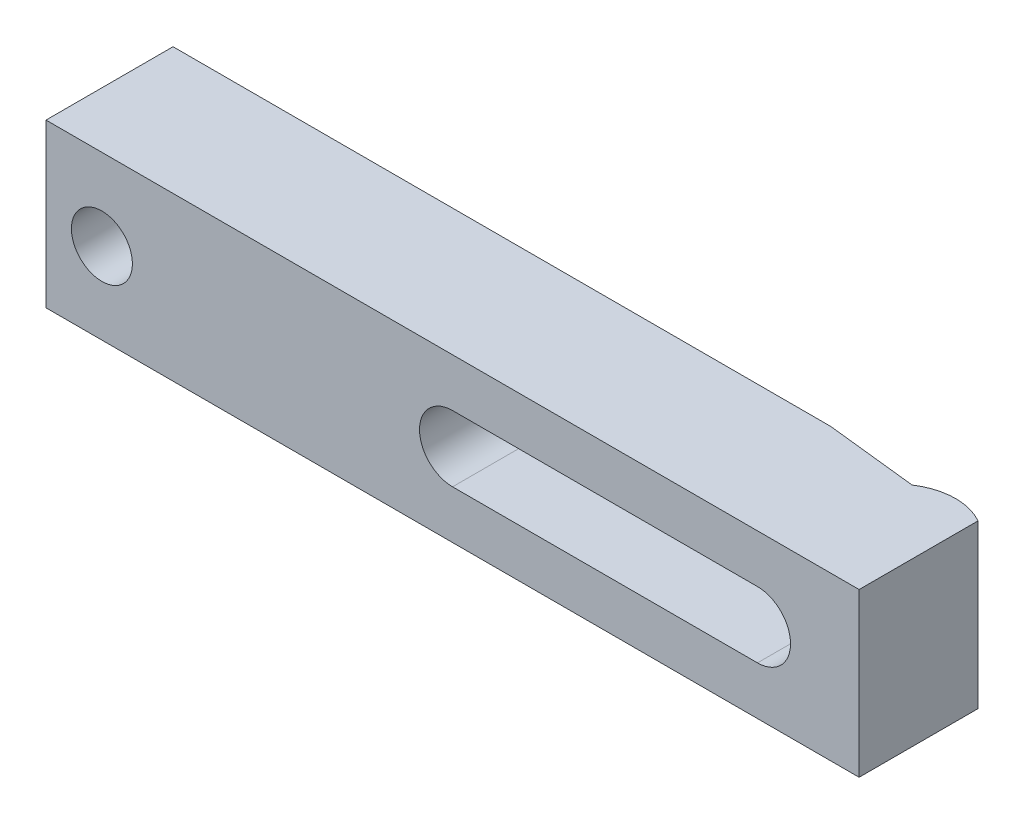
ISO-10303-21;
HEADER;
FILE_DESCRIPTION(('STEP AP214'),'2;1');
FILE_NAME('part.step','',(''),(''),'','','');
FILE_SCHEMA(('AUTOMOTIVE_DESIGN { 1 0 10303 214 1 1 1 1 }'));
ENDSEC;
DATA;
#1=APPLICATION_CONTEXT('core data for automotive mechanical design processes');
#2=APPLICATION_PROTOCOL_DEFINITION('international standard','automotive_design',2000,#1);
#3=PRODUCT_CONTEXT('',#1,'mechanical');
#4=PRODUCT('Part','Part','',(#3));
#5=PRODUCT_RELATED_PRODUCT_CATEGORY('part','',(#4));
#6=PRODUCT_DEFINITION_FORMATION('','',#4);
#7=PRODUCT_DEFINITION_CONTEXT('part definition',#1,'design');
#8=PRODUCT_DEFINITION('design','',#6,#7);
#9=PRODUCT_DEFINITION_SHAPE('','',#8);
#10=(LENGTH_UNIT() NAMED_UNIT(*) SI_UNIT(.MILLI.,.METRE.));
#11=(NAMED_UNIT(*) PLANE_ANGLE_UNIT() SI_UNIT($,.RADIAN.));
#12=(NAMED_UNIT(*) SI_UNIT($,.STERADIAN.) SOLID_ANGLE_UNIT());
#13=UNCERTAINTY_MEASURE_WITH_UNIT(LENGTH_MEASURE(1.E-05),#10,'distance_accuracy_value','');
#14=(GEOMETRIC_REPRESENTATION_CONTEXT(3) GLOBAL_UNCERTAINTY_ASSIGNED_CONTEXT((#13)) GLOBAL_UNIT_ASSIGNED_CONTEXT((#10,
#11,#12)) REPRESENTATION_CONTEXT('',''));
#15=CARTESIAN_POINT('',(0.,0.,0.));
#16=DIRECTION('',(0.,0.,1.));
#17=DIRECTION('',(1.,0.,0.));
#18=AXIS2_PLACEMENT_3D('',#15,#16,#17);
#19=CARTESIAN_POINT('',(-140.,16.,0.));
#20=DIRECTION('',(0.,0.,-1.));
#21=DIRECTION('',(-1.,0.,0.));
#22=AXIS2_PLACEMENT_3D('',#19,#20,#21);
#23=PLANE('',#22);
#24=DIRECTION('',(1.,0.,0.));
#25=VECTOR('',#24,1.);
#26=CARTESIAN_POINT('',(-60.,6.5,0.));
#27=LINE('',#26,#25);
#28=CARTESIAN_POINT('',(-140.,6.5,0.));
#29=VERTEX_POINT('',#28);
#30=CARTESIAN_POINT('',(-10.6,6.5,0.));
#31=VERTEX_POINT('',#30);
#32=EDGE_CURVE('E122',#29,#31,#27,.T.);
#33=ORIENTED_EDGE('',*,*,#32,.F.);
#34=DIRECTION('',(0.,-1.,0.));
#35=VECTOR('',#34,1.);
#36=CARTESIAN_POINT('',(-140.,16.,0.));
#37=LINE('',#36,#35);
#38=CARTESIAN_POINT('',(-140.,16.,0.));
#39=VERTEX_POINT('',#38);
#40=EDGE_CURVE('E139',#39,#29,#37,.T.);
#41=ORIENTED_EDGE('',*,*,#40,.F.);
#42=DIRECTION('',(1.,0.,0.));
#43=VECTOR('',#42,1.);
#44=CARTESIAN_POINT('',(-140.,16.,0.));
#45=LINE('',#44,#43);
#46=CARTESIAN_POINT('',(-10.6,16.,0.));
#47=VERTEX_POINT('',#46);
#48=EDGE_CURVE('E196',#39,#47,#45,.T.);
#49=ORIENTED_EDGE('',*,*,#48,.T.);
#50=DIRECTION('',(0.,-1.,0.));
#51=VECTOR('',#50,1.);
#52=CARTESIAN_POINT('',(-10.6,16.,0.));
#53=LINE('',#52,#51);
#54=EDGE_CURVE('E147',#47,#31,#53,.T.);
#55=ORIENTED_EDGE('',*,*,#54,.T.);
#56=EDGE_LOOP('',(#33,#41,#49,#55));
#57=FACE_BOUND('',#56,.T.);
#58=ADVANCED_FACE('F14',(#57),#23,.T.);
#59=CARTESIAN_POINT('',(-140.,16.,25.));
#60=DIRECTION('',(-1.,0.,0.));
#61=DIRECTION('',(0.,0.,1.));
#62=AXIS2_PLACEMENT_3D('',#59,#60,#61);
#63=PLANE('',#62);
#64=ORIENTED_EDGE('',*,*,#40,.T.);
#65=DIRECTION('',(0.,0.,1.));
#66=VECTOR('',#65,1.);
#67=CARTESIAN_POINT('',(-140.,6.5,25.));
#68=LINE('',#67,#66);
#69=CARTESIAN_POINT('',(-140.,6.5,5.));
#70=VERTEX_POINT('',#69);
#71=EDGE_CURVE('E133',#29,#70,#68,.T.);
#72=ORIENTED_EDGE('',*,*,#71,.T.);
#73=DIRECTION('',(0.,-1.,0.));
#74=VECTOR('',#73,1.);
#75=CARTESIAN_POINT('',(-140.,16.,5.));
#76=LINE('',#75,#74);
#77=CARTESIAN_POINT('',(-140.,-6.5,5.));
#78=VERTEX_POINT('',#77);
#79=EDGE_CURVE('E132',#70,#78,#76,.T.);
#80=ORIENTED_EDGE('',*,*,#79,.T.);
#81=DIRECTION('',(0.,0.,1.));
#82=VECTOR('',#81,1.);
#83=CARTESIAN_POINT('',(-140.,-6.5,25.));
#84=LINE('',#83,#82);
#85=CARTESIAN_POINT('',(-140.,-6.5,0.));
#86=VERTEX_POINT('',#85);
#87=EDGE_CURVE('E115',#86,#78,#84,.T.);
#88=ORIENTED_EDGE('',*,*,#87,.F.);
#89=CARTESIAN_POINT('',(-140.,-16.,0.));
#90=VERTEX_POINT('',#89);
#91=EDGE_CURVE('E129',#86,#90,#37,.T.);
#92=ORIENTED_EDGE('',*,*,#91,.T.);
#93=DIRECTION('',(0.,0.,-1.));
#94=VECTOR('',#93,1.);
#95=CARTESIAN_POINT('',(-140.,-16.,25.));
#96=LINE('',#95,#94);
#97=CARTESIAN_POINT('',(-140.,-16.,25.));
#98=VERTEX_POINT('',#97);
#99=EDGE_CURVE('E169',#98,#90,#96,.T.);
#100=ORIENTED_EDGE('',*,*,#99,.F.);
#101=DIRECTION('',(0.,-1.,0.));
#102=VECTOR('',#101,1.);
#103=CARTESIAN_POINT('',(-140.,16.,25.));
#104=LINE('',#103,#102);
#105=CARTESIAN_POINT('',(-140.,16.,25.));
#106=VERTEX_POINT('',#105);
#107=EDGE_CURVE('E140',#106,#98,#104,.T.);
#108=ORIENTED_EDGE('',*,*,#107,.F.);
#109=DIRECTION('',(0.,0.,-1.));
#110=VECTOR('',#109,1.);
#111=CARTESIAN_POINT('',(-140.,16.,25.));
#112=LINE('',#111,#110);
#113=EDGE_CURVE('E179',#106,#39,#112,.T.);
#114=ORIENTED_EDGE('',*,*,#113,.T.);
#115=EDGE_LOOP('',(#64,#72,#80,#88,#92,#100,#108,#114));
#116=FACE_BOUND('',#115,.T.);
#117=ADVANCED_FACE('F127',(#116),#63,.T.);
#118=CARTESIAN_POINT('',(-60.,0.,25.));
#119=DIRECTION('',(0.,0.,-1.));
#120=DIRECTION('',(-1.,0.,0.));
#121=AXIS2_PLACEMENT_3D('',#118,#119,#120);
#122=CYLINDRICAL_SURFACE('',#121,6.5);
#123=DIRECTION('',(0.,0.,-1.));
#124=VECTOR('',#123,1.);
#125=CARTESIAN_POINT('',(-60.,-6.5,25.));
#126=LINE('',#125,#124);
#127=CARTESIAN_POINT('',(-60.,-6.5,25.));
#128=VERTEX_POINT('',#127);
#129=CARTESIAN_POINT('',(-60.,-6.5,5.));
#130=VERTEX_POINT('',#129);
#131=EDGE_CURVE('E229',#128,#130,#126,.T.);
#132=ORIENTED_EDGE('',*,*,#131,.T.);
#133=CARTESIAN_POINT('',(-60.,0.,5.));
#134=DIRECTION('',(0.,0.,-1.));
#135=DIRECTION('',(-1.,0.,0.));
#136=AXIS2_PLACEMENT_3D('',#133,#134,#135);
#137=CIRCLE('',#136,6.5);
#138=CARTESIAN_POINT('',(-60.,6.5,5.));
#139=VERTEX_POINT('',#138);
#140=EDGE_CURVE('E245',#130,#139,#137,.T.);
#141=ORIENTED_EDGE('',*,*,#140,.T.);
#142=DIRECTION('',(0.,0.,-1.));
#143=VECTOR('',#142,1.);
#144=CARTESIAN_POINT('',(-60.,6.5,25.));
#145=LINE('',#144,#143);
#146=CARTESIAN_POINT('',(-60.,6.5,25.));
#147=VERTEX_POINT('',#146);
#148=EDGE_CURVE('E231',#147,#139,#145,.T.);
#149=ORIENTED_EDGE('',*,*,#148,.F.);
#150=CARTESIAN_POINT('',(-60.,0.,25.));
#151=DIRECTION('',(0.,0.,1.));
#152=DIRECTION('',(1.,0.,0.));
#153=AXIS2_PLACEMENT_3D('',#150,#151,#152);
#154=CIRCLE('',#153,6.5);
#155=EDGE_CURVE('E38',#147,#128,#154,.T.);
#156=ORIENTED_EDGE('',*,*,#155,.T.);
#157=EDGE_LOOP('',(#132,#141,#149,#156));
#158=FACE_BOUND('',#157,.T.);
#159=ADVANCED_FACE('F244',(#158),#122,.F.);
#160=CARTESIAN_POINT('',(-129.,0.,25.));
#161=DIRECTION('',(0.,0.,-1.));
#162=DIRECTION('',(-1.,0.,0.));
#163=AXIS2_PLACEMENT_3D('',#160,#161,#162);
#164=CYLINDRICAL_SURFACE('',#163,6.);
#165=CARTESIAN_POINT('',(-129.,0.,25.));
#166=DIRECTION('',(0.,0.,1.));
#167=DIRECTION('',(1.,0.,0.));
#168=AXIS2_PLACEMENT_3D('',#165,#166,#167);
#169=CIRCLE('',#168,6.);
#170=CARTESIAN_POINT('',(-123.,0.,25.));
#171=VERTEX_POINT('',#170);
#172=EDGE_CURVE('E209',#171,#171,#169,.T.);
#173=ORIENTED_EDGE('',*,*,#172,.T.);
#174=EDGE_LOOP('',(#173));
#175=FACE_BOUND('',#174,.T.);
#176=CARTESIAN_POINT('',(-129.,0.,5.));
#177=DIRECTION('',(0.,0.,-1.));
#178=DIRECTION('',(-1.,0.,0.));
#179=AXIS2_PLACEMENT_3D('',#176,#177,#178);
#180=CIRCLE('',#179,6.);
#181=CARTESIAN_POINT('',(-135.,0.,5.));
#182=VERTEX_POINT('',#181);
#183=EDGE_CURVE('E18',#182,#182,#180,.T.);
#184=ORIENTED_EDGE('',*,*,#183,.T.);
#185=EDGE_LOOP('',(#184));
#186=FACE_BOUND('',#185,.T.);
#187=ADVANCED_FACE('F278',(#175,#186),#164,.F.);
#188=CARTESIAN_POINT('',(20.,16.,25.));
#189=DIRECTION('',(0.,0.,1.));
#190=DIRECTION('',(1.,0.,0.));
#191=AXIS2_PLACEMENT_3D('',#188,#189,#190);
#192=PLANE('',#191);
#193=DIRECTION('',(1.,0.,0.));
#194=VECTOR('',#193,1.);
#195=CARTESIAN_POINT('',(-60.,6.5,25.));
#196=LINE('',#195,#194);
#197=CARTESIAN_POINT('',(0.,6.5,25.));
#198=VERTEX_POINT('',#197);
#199=EDGE_CURVE('E223',#147,#198,#196,.T.);
#200=ORIENTED_EDGE('',*,*,#199,.T.);
#201=CARTESIAN_POINT('',(0.,0.,25.));
#202=DIRECTION('',(0.,0.,1.));
#203=DIRECTION('',(1.,0.,0.));
#204=AXIS2_PLACEMENT_3D('',#201,#202,#203);
#205=CIRCLE('',#204,6.5);
#206=CARTESIAN_POINT('',(0.,-6.5,25.));
#207=VERTEX_POINT('',#206);
#208=EDGE_CURVE('E121',#207,#198,#205,.T.);
#209=ORIENTED_EDGE('',*,*,#208,.F.);
#210=DIRECTION('',(-1.,0.,0.));
#211=VECTOR('',#210,1.);
#212=CARTESIAN_POINT('',(0.,-6.5,25.));
#213=LINE('',#212,#211);
#214=EDGE_CURVE('E218',#207,#128,#213,.T.);
#215=ORIENTED_EDGE('',*,*,#214,.T.);
#216=ORIENTED_EDGE('',*,*,#155,.F.);
#217=EDGE_LOOP('',(#200,#209,#215,#216));
#218=FACE_BOUND('',#217,.T.);
#219=DIRECTION('',(0.,-1.,0.));
#220=VECTOR('',#219,1.);
#221=CARTESIAN_POINT('',(20.,16.,25.));
#222=LINE('',#221,#220);
#223=CARTESIAN_POINT('',(20.,16.,25.));
#224=VERTEX_POINT('',#223);
#225=CARTESIAN_POINT('',(20.,-16.,25.));
#226=VERTEX_POINT('',#225);
#227=EDGE_CURVE('E23',#224,#226,#222,.T.);
#228=ORIENTED_EDGE('',*,*,#227,.F.);
#229=DIRECTION('',(-1.,0.,0.));
#230=VECTOR('',#229,1.);
#231=CARTESIAN_POINT('',(20.,16.,25.));
#232=LINE('',#231,#230);
#233=EDGE_CURVE('E177',#224,#106,#232,.T.);
#234=ORIENTED_EDGE('',*,*,#233,.T.);
#235=ORIENTED_EDGE('',*,*,#107,.T.);
#236=DIRECTION('',(-1.,0.,0.));
#237=VECTOR('',#236,1.);
#238=CARTESIAN_POINT('',(20.,-16.,25.));
#239=LINE('',#238,#237);
#240=EDGE_CURVE('E165',#226,#98,#239,.T.);
#241=ORIENTED_EDGE('',*,*,#240,.F.);
#242=EDGE_LOOP('',(#228,#234,#235,#241));
#243=FACE_BOUND('',#242,.T.);
#244=ORIENTED_EDGE('',*,*,#172,.F.);
#245=EDGE_LOOP('',(#244));
#246=FACE_BOUND('',#245,.T.);
#247=ADVANCED_FACE('F166',(#218,#243,#246),#192,.T.);
#248=ORIENTED_EDGE('',*,*,#91,.F.);
#249=DIRECTION('',(-1.,0.,0.));
#250=VECTOR('',#249,1.);
#251=CARTESIAN_POINT('',(0.,-6.5,0.));
#252=LINE('',#251,#250);
#253=CARTESIAN_POINT('',(-10.6,-6.5,0.));
#254=VERTEX_POINT('',#253);
#255=EDGE_CURVE('E110',#254,#86,#252,.T.);
#256=ORIENTED_EDGE('',*,*,#255,.F.);
#257=CARTESIAN_POINT('',(-10.6,-16.,0.));
#258=VERTEX_POINT('',#257);
#259=EDGE_CURVE('E142',#254,#258,#53,.T.);
#260=ORIENTED_EDGE('',*,*,#259,.T.);
#261=DIRECTION('',(1.,0.,0.));
#262=VECTOR('',#261,1.);
#263=CARTESIAN_POINT('',(-140.,-16.,0.));
#264=LINE('',#263,#262);
#265=EDGE_CURVE('E138',#90,#258,#264,.T.);
#266=ORIENTED_EDGE('',*,*,#265,.F.);
#267=EDGE_LOOP('',(#248,#256,#260,#266));
#268=FACE_BOUND('',#267,.T.);
#269=ADVANCED_FACE('F136',(#268),#23,.T.);
#270=CARTESIAN_POINT('',(20.,16.,25.));
#271=DIRECTION('',(-1.,0.,0.));
#272=DIRECTION('',(0.,0.,1.));
#273=AXIS2_PLACEMENT_3D('',#270,#271,#272);
#274=PLANE('',#273);
#275=DIRECTION('',(0.,-1.,0.));
#276=VECTOR('',#275,1.);
#277=CARTESIAN_POINT('',(20.,16.,1.60769515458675));
#278=LINE('',#277,#276);
#279=CARTESIAN_POINT('',(20.,16.,1.60769515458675));
#280=VERTEX_POINT('',#279);
#281=CARTESIAN_POINT('',(20.,-16.,1.60769515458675));
#282=VERTEX_POINT('',#281);
#283=EDGE_CURVE('E152',#280,#282,#278,.T.);
#284=ORIENTED_EDGE('',*,*,#283,.F.);
#285=DIRECTION('',(0.,0.,-1.));
#286=VECTOR('',#285,1.);
#287=CARTESIAN_POINT('',(20.,16.,25.));
#288=LINE('',#287,#286);
#289=EDGE_CURVE('E143',#224,#280,#288,.T.);
#290=ORIENTED_EDGE('',*,*,#289,.F.);
#291=ORIENTED_EDGE('',*,*,#227,.T.);
#292=DIRECTION('',(0.,0.,-1.));
#293=VECTOR('',#292,1.);
#294=CARTESIAN_POINT('',(20.,-16.,25.));
#295=LINE('',#294,#293);
#296=EDGE_CURVE('E159',#226,#282,#295,.T.);
#297=ORIENTED_EDGE('',*,*,#296,.T.);
#298=EDGE_LOOP('',(#284,#290,#291,#297));
#299=FACE_BOUND('',#298,.T.);
#300=ADVANCED_FACE('F16',(#299),#274,.F.);
#301=CARTESIAN_POINT('',(14.,16.,12.));
#302=DIRECTION('',(0.,-1.,0.));
#303=DIRECTION('',(0.,0.,-1.));
#304=AXIS2_PLACEMENT_3D('',#301,#302,#303);
#305=CYLINDRICAL_SURFACE('',#304,12.);
#306=DIRECTION('',(0.,-1.,0.));
#307=VECTOR('',#306,1.);
#308=CARTESIAN_POINT('',(7.4,16.,1.97802414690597));
#309=LINE('',#308,#307);
#310=CARTESIAN_POINT('',(7.4,16.,1.97802414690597));
#311=VERTEX_POINT('',#310);
#312=CARTESIAN_POINT('',(7.4,-16.,1.97802414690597));
#313=VERTEX_POINT('',#312);
#314=EDGE_CURVE('E150',#311,#313,#309,.T.);
#315=ORIENTED_EDGE('',*,*,#314,.F.);
#316=CARTESIAN_POINT('',(14.,16.,12.));
#317=DIRECTION('',(0.,1.,0.));
#318=DIRECTION('',(0.,0.,1.));
#319=AXIS2_PLACEMENT_3D('',#316,#317,#318);
#320=CIRCLE('',#319,12.);
#321=EDGE_CURVE('E190',#280,#311,#320,.T.);
#322=ORIENTED_EDGE('',*,*,#321,.F.);
#323=ORIENTED_EDGE('',*,*,#283,.T.);
#324=CARTESIAN_POINT('',(14.,-16.,12.));
#325=DIRECTION('',(0.,1.,0.));
#326=DIRECTION('',(0.,0.,1.));
#327=AXIS2_PLACEMENT_3D('',#324,#325,#326);
#328=CIRCLE('',#327,12.);
#329=EDGE_CURVE('E176',#282,#313,#328,.T.);
#330=ORIENTED_EDGE('',*,*,#329,.T.);
#331=EDGE_LOOP('',(#315,#322,#323,#330));
#332=FACE_BOUND('',#331,.T.);
#333=ADVANCED_FACE('F277',(#332),#305,.T.);
#334=CARTESIAN_POINT('',(7.4,16.,1.97802414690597));
#335=DIRECTION('',(-0.109232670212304,0.,0.99401620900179));
#336=DIRECTION('',(0.99401620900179,0.,0.109232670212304));
#337=AXIS2_PLACEMENT_3D('',#334,#335,#336);
#338=PLANE('',#337);
#339=CARTESIAN_POINT('',(0.,0.,1.16483644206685));
#340=DIRECTION('',(-0.109232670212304,0.,0.99401620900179));
#341=DIRECTION('',(-0.99401620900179,0.,-0.109232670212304));
#342=AXIS2_PLACEMENT_3D('',#339,#340,#341);
#343=ELLIPSE('',#342,6.53912877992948,6.5);
#344=CARTESIAN_POINT('',(0.,6.5,1.16483644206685));
#345=VERTEX_POINT('',#344);
#346=CARTESIAN_POINT('',(0.,-6.5,1.16483644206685));
#347=VERTEX_POINT('',#346);
#348=EDGE_CURVE('E9',#345,#347,#343,.F.);
#349=ORIENTED_EDGE('',*,*,#348,.F.);
#350=DIRECTION('',(-0.99401620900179,0.,-0.109232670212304));
#351=VECTOR('',#350,1.);
#352=CARTESIAN_POINT('',(7.4,6.5,1.97802414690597));
#353=LINE('',#352,#351);
#354=EDGE_CURVE('E170',#345,#31,#353,.T.);
#355=ORIENTED_EDGE('',*,*,#354,.T.);
#356=ORIENTED_EDGE('',*,*,#54,.F.);
#357=DIRECTION('',(-0.99401620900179,0.,-0.109232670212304));
#358=VECTOR('',#357,1.);
#359=CARTESIAN_POINT('',(7.4,16.,1.97802414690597));
#360=LINE('',#359,#358);
#361=EDGE_CURVE('E193',#311,#47,#360,.T.);
#362=ORIENTED_EDGE('',*,*,#361,.F.);
#363=ORIENTED_EDGE('',*,*,#314,.T.);
#364=DIRECTION('',(-0.99401620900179,0.,-0.109232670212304));
#365=VECTOR('',#364,1.);
#366=CARTESIAN_POINT('',(7.4,-16.,1.97802414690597));
#367=LINE('',#366,#365);
#368=EDGE_CURVE('E180',#313,#258,#367,.T.);
#369=ORIENTED_EDGE('',*,*,#368,.T.);
#370=ORIENTED_EDGE('',*,*,#259,.F.);
#371=DIRECTION('',(0.99401620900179,0.,0.109232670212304));
#372=VECTOR('',#371,1.);
#373=CARTESIAN_POINT('',(7.4,-6.5,1.97802414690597));
#374=LINE('',#373,#372);
#375=EDGE_CURVE('E117',#254,#347,#374,.T.);
#376=ORIENTED_EDGE('',*,*,#375,.T.);
#377=EDGE_LOOP('',(#349,#355,#356,#362,#363,#369,#370,#376));
#378=FACE_BOUND('',#377,.T.);
#379=ADVANCED_FACE('F237',(#378),#338,.F.);
#380=CARTESIAN_POINT('',(14.,16.,12.));
#381=DIRECTION('',(0.,1.,0.));
#382=DIRECTION('',(0.,0.,1.));
#383=AXIS2_PLACEMENT_3D('',#380,#381,#382);
#384=PLANE('',#383);
#385=ORIENTED_EDGE('',*,*,#233,.F.);
#386=ORIENTED_EDGE('',*,*,#289,.T.);
#387=ORIENTED_EDGE('',*,*,#321,.T.);
#388=ORIENTED_EDGE('',*,*,#361,.T.);
#389=ORIENTED_EDGE('',*,*,#48,.F.);
#390=ORIENTED_EDGE('',*,*,#113,.F.);
#391=EDGE_LOOP('',(#385,#386,#387,#388,#389,#390));
#392=FACE_BOUND('',#391,.T.);
#393=ADVANCED_FACE('F203',(#392),#384,.T.);
#394=CARTESIAN_POINT('',(14.,-16.,12.));
#395=DIRECTION('',(0.,1.,0.));
#396=DIRECTION('',(0.,0.,1.));
#397=AXIS2_PLACEMENT_3D('',#394,#395,#396);
#398=PLANE('',#397);
#399=ORIENTED_EDGE('',*,*,#240,.T.);
#400=ORIENTED_EDGE('',*,*,#99,.T.);
#401=ORIENTED_EDGE('',*,*,#265,.T.);
#402=ORIENTED_EDGE('',*,*,#368,.F.);
#403=ORIENTED_EDGE('',*,*,#329,.F.);
#404=ORIENTED_EDGE('',*,*,#296,.F.);
#405=EDGE_LOOP('',(#399,#400,#401,#402,#403,#404));
#406=FACE_BOUND('',#405,.T.);
#407=ADVANCED_FACE('F173',(#406),#398,.F.);
#408=CARTESIAN_POINT('',(0.,0.,25.));
#409=DIRECTION('',(0.,0.,-1.));
#410=DIRECTION('',(-1.,0.,0.));
#411=AXIS2_PLACEMENT_3D('',#408,#409,#410);
#412=CYLINDRICAL_SURFACE('',#411,6.5);
#413=ORIENTED_EDGE('',*,*,#348,.T.);
#414=DIRECTION('',(0.,0.,-1.));
#415=VECTOR('',#414,1.);
#416=CARTESIAN_POINT('',(0.,-6.5,25.));
#417=LINE('',#416,#415);
#418=EDGE_CURVE('E221',#207,#347,#417,.T.);
#419=ORIENTED_EDGE('',*,*,#418,.F.);
#420=ORIENTED_EDGE('',*,*,#208,.T.);
#421=DIRECTION('',(0.,0.,-1.));
#422=VECTOR('',#421,1.);
#423=CARTESIAN_POINT('',(0.,6.5,25.));
#424=LINE('',#423,#422);
#425=EDGE_CURVE('E233',#198,#345,#424,.T.);
#426=ORIENTED_EDGE('',*,*,#425,.T.);
#427=EDGE_LOOP('',(#413,#419,#420,#426));
#428=FACE_BOUND('',#427,.T.);
#429=ADVANCED_FACE('F240',(#428),#412,.F.);
#430=CARTESIAN_POINT('',(-60.,6.5,25.));
#431=DIRECTION('',(0.,1.,0.));
#432=DIRECTION('',(-1.,0.,0.));
#433=AXIS2_PLACEMENT_3D('',#430,#431,#432);
#434=PLANE('',#433);
#435=ORIENTED_EDGE('',*,*,#32,.T.);
#436=ORIENTED_EDGE('',*,*,#354,.F.);
#437=ORIENTED_EDGE('',*,*,#425,.F.);
#438=ORIENTED_EDGE('',*,*,#199,.F.);
#439=ORIENTED_EDGE('',*,*,#148,.T.);
#440=DIRECTION('',(-1.,0.,0.));
#441=VECTOR('',#440,1.);
#442=CARTESIAN_POINT('',(-10.,6.5,5.));
#443=LINE('',#442,#441);
#444=EDGE_CURVE('E30',#139,#70,#443,.T.);
#445=ORIENTED_EDGE('',*,*,#444,.T.);
#446=ORIENTED_EDGE('',*,*,#71,.F.);
#447=EDGE_LOOP('',(#435,#436,#437,#438,#439,#445,#446));
#448=FACE_BOUND('',#447,.T.);
#449=ADVANCED_FACE('F211',(#448),#434,.F.);
#450=CARTESIAN_POINT('',(0.,-6.5,25.));
#451=DIRECTION('',(0.,-1.,0.));
#452=DIRECTION('',(1.,0.,0.));
#453=AXIS2_PLACEMENT_3D('',#450,#451,#452);
#454=PLANE('',#453);
#455=ORIENTED_EDGE('',*,*,#418,.T.);
#456=ORIENTED_EDGE('',*,*,#375,.F.);
#457=ORIENTED_EDGE('',*,*,#255,.T.);
#458=ORIENTED_EDGE('',*,*,#87,.T.);
#459=DIRECTION('',(-1.,0.,0.));
#460=VECTOR('',#459,1.);
#461=CARTESIAN_POINT('',(-10.,-6.5,5.));
#462=LINE('',#461,#460);
#463=EDGE_CURVE('E249',#130,#78,#462,.T.);
#464=ORIENTED_EDGE('',*,*,#463,.F.);
#465=ORIENTED_EDGE('',*,*,#131,.F.);
#466=ORIENTED_EDGE('',*,*,#214,.F.);
#467=EDGE_LOOP('',(#455,#456,#457,#458,#464,#465,#466));
#468=FACE_BOUND('',#467,.T.);
#469=ADVANCED_FACE('F113',(#468),#454,.F.);
#470=CARTESIAN_POINT('',(-10.,6.5,5.));
#471=DIRECTION('',(0.,0.,-1.));
#472=DIRECTION('',(-1.,0.,0.));
#473=AXIS2_PLACEMENT_3D('',#470,#471,#472);
#474=PLANE('',#473);
#475=ORIENTED_EDGE('',*,*,#183,.F.);
#476=EDGE_LOOP('',(#475));
#477=FACE_BOUND('',#476,.T.);
#478=ORIENTED_EDGE('',*,*,#444,.F.);
#479=ORIENTED_EDGE('',*,*,#140,.F.);
#480=ORIENTED_EDGE('',*,*,#463,.T.);
#481=ORIENTED_EDGE('',*,*,#79,.F.);
#482=EDGE_LOOP('',(#478,#479,#480,#481));
#483=FACE_BOUND('',#482,.T.);
#484=ADVANCED_FACE('F251',(#477,#483),#474,.T.);
#485=CLOSED_SHELL('',(#58,#117,#159,#187,#247,#269,#300,#333,#379,#393,#407,#429,#449,#469,#484));
#486=MANIFOLD_SOLID_BREP('B1',#485);
#487=ADVANCED_BREP_SHAPE_REPRESENTATION('',(#18,#486),#14);
#488=SHAPE_DEFINITION_REPRESENTATION(#9,#487);
ENDSEC;
END-ISO-10303-21;
